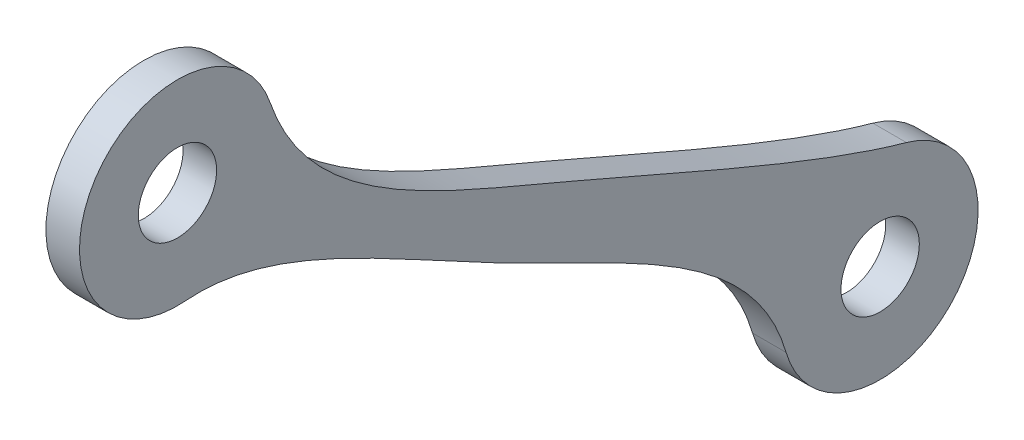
ISO-10303-21;
HEADER;
FILE_DESCRIPTION(('STEP AP214'),'2;1');
FILE_NAME('part.step','',(''),(''),'','','');
FILE_SCHEMA(('AUTOMOTIVE_DESIGN { 1 0 10303 214 1 1 1 1 }'));
ENDSEC;
DATA;
#1=APPLICATION_CONTEXT('core data for automotive mechanical design processes');
#2=APPLICATION_PROTOCOL_DEFINITION('international standard','automotive_design',2000,#1);
#3=PRODUCT_CONTEXT('',#1,'mechanical');
#4=PRODUCT('Part','Part','',(#3));
#5=PRODUCT_RELATED_PRODUCT_CATEGORY('part','',(#4));
#6=PRODUCT_DEFINITION_FORMATION('','',#4);
#7=PRODUCT_DEFINITION_CONTEXT('part definition',#1,'design');
#8=PRODUCT_DEFINITION('design','',#6,#7);
#9=PRODUCT_DEFINITION_SHAPE('','',#8);
#10=(LENGTH_UNIT() NAMED_UNIT(*) SI_UNIT(.MILLI.,.METRE.));
#11=(NAMED_UNIT(*) PLANE_ANGLE_UNIT() SI_UNIT($,.RADIAN.));
#12=(NAMED_UNIT(*) SI_UNIT($,.STERADIAN.) SOLID_ANGLE_UNIT());
#13=UNCERTAINTY_MEASURE_WITH_UNIT(LENGTH_MEASURE(1.E-05),#10,'distance_accuracy_value','');
#14=(GEOMETRIC_REPRESENTATION_CONTEXT(3) GLOBAL_UNCERTAINTY_ASSIGNED_CONTEXT((#13)) GLOBAL_UNIT_ASSIGNED_CONTEXT((#10,
#11,#12)) REPRESENTATION_CONTEXT('',''));
#15=CARTESIAN_POINT('',(0.,0.,0.));
#16=DIRECTION('',(0.,0.,1.));
#17=DIRECTION('',(1.,0.,0.));
#18=AXIS2_PLACEMENT_3D('',#15,#16,#17);
#19=CARTESIAN_POINT('',(-1.13097354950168,47.4370138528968,41.71175698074));
#20=DIRECTION('',(1.,0.,0.));
#21=DIRECTION('',(0.,0.,-1.));
#22=AXIS2_PLACEMENT_3D('',#19,#20,#21);
#23=CYLINDRICAL_SURFACE('',#22,8.75);
#24=DIRECTION('',(-1.,0.,0.));
#25=VECTOR('',#24,1.);
#26=CARTESIAN_POINT('',(-1.13097354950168,38.7172742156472,40.9846801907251));
#27=LINE('',#26,#25);
#28=CARTESIAN_POINT('',(1.86902645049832,38.7172742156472,40.9846801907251));
#29=VERTEX_POINT('',#28);
#30=CARTESIAN_POINT('',(-1.13097354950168,38.7172742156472,40.9846801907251));
#31=VERTEX_POINT('',#30);
#32=EDGE_CURVE('E11',#29,#31,#27,.T.);
#33=ORIENTED_EDGE('',*,*,#32,.F.);
#34=CARTESIAN_POINT('',(1.86902645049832,47.4370138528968,41.71175698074));
#35=DIRECTION('',(1.,0.,0.));
#36=DIRECTION('',(0.,0.,-1.));
#37=AXIS2_PLACEMENT_3D('',#34,#35,#36);
#38=CIRCLE('',#37,8.75);
#39=CARTESIAN_POINT('',(1.86902645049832,50.2754909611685,33.4349491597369));
#40=VERTEX_POINT('',#39);
#41=EDGE_CURVE('E98',#40,#29,#38,.T.);
#42=ORIENTED_EDGE('',*,*,#41,.F.);
#43=DIRECTION('',(-1.,0.,0.));
#44=VECTOR('',#43,1.);
#45=CARTESIAN_POINT('',(-1.13097354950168,50.2754909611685,33.4349491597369));
#46=LINE('',#45,#44);
#47=CARTESIAN_POINT('',(-1.13097354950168,50.2754909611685,33.4349491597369));
#48=VERTEX_POINT('',#47);
#49=EDGE_CURVE('E52',#40,#48,#46,.T.);
#50=ORIENTED_EDGE('',*,*,#49,.T.);
#51=CARTESIAN_POINT('',(-1.13097354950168,47.4370138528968,41.71175698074));
#52=DIRECTION('',(1.,0.,0.));
#53=DIRECTION('',(0.,0.,-1.));
#54=AXIS2_PLACEMENT_3D('',#51,#52,#53);
#55=CIRCLE('',#54,8.75);
#56=EDGE_CURVE('E128',#48,#31,#55,.T.);
#57=ORIENTED_EDGE('',*,*,#56,.T.);
#58=EDGE_LOOP('',(#33,#42,#50,#57));
#59=FACE_BOUND('',#58,.T.);
#60=ADVANCED_FACE('F42',(#59),#23,.T.);
#61=CARTESIAN_POINT('',(-1.13097354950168,50.2754909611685,33.4349491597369));
#62=CARTESIAN_POINT('',(-1.13097354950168,40.2797838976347,30.0069867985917));
#63=CARTESIAN_POINT('',(-1.13097354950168,31.5510925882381,7.34232732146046));
#64=CARTESIAN_POINT('',(-1.13097354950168,21.1323833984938,-14.8916890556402));
#65=CARTESIAN_POINT('',(-1.13097354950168,18.7643385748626,-23.4045328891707));
#66=B_SPLINE_CURVE_WITH_KNOTS('',3,(#61,#62,#63,#64,#65),.UNSPECIFIED.,.F.,.F.,(4,1,4),(0.,
0.472412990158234,1.),.UNSPECIFIED.);
#67=DIRECTION('',(1.,0.,0.));
#68=VECTOR('',#67,1.);
#69=SURFACE_OF_LINEAR_EXTRUSION('',#66,#68);
#70=ORIENTED_EDGE('',*,*,#49,.F.);
#71=CARTESIAN_POINT('',(1.86902645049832,50.2754909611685,33.4349491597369));
#72=CARTESIAN_POINT('',(1.86902645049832,40.2797838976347,30.0069867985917));
#73=CARTESIAN_POINT('',(1.86902645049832,31.5510925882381,7.34232732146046));
#74=CARTESIAN_POINT('',(1.86902645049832,21.1323833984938,-14.8916890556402));
#75=CARTESIAN_POINT('',(1.86902645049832,18.7643385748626,-23.4045328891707));
#76=B_SPLINE_CURVE_WITH_KNOTS('',3,(#71,#72,#73,#74,#75),.UNSPECIFIED.,.F.,.F.,(4,1,4),(0.,
0.472412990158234,1.),.UNSPECIFIED.);
#77=CARTESIAN_POINT('',(1.86902645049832,18.7643385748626,-23.4045328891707));
#78=VERTEX_POINT('',#77);
#79=EDGE_CURVE('E109',#40,#78,#76,.T.);
#80=ORIENTED_EDGE('',*,*,#79,.T.);
#81=DIRECTION('',(-1.,0.,0.));
#82=VECTOR('',#81,1.);
#83=CARTESIAN_POINT('',(-1.13097354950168,18.7643385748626,-23.4045328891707));
#84=LINE('',#83,#82);
#85=CARTESIAN_POINT('',(-1.13097354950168,18.7643385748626,-23.4045328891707));
#86=VERTEX_POINT('',#85);
#87=EDGE_CURVE('E60',#78,#86,#84,.T.);
#88=ORIENTED_EDGE('',*,*,#87,.T.);
#89=EDGE_CURVE('E133',#48,#86,#66,.T.);
#90=ORIENTED_EDGE('',*,*,#89,.F.);
#91=EDGE_LOOP('',(#70,#80,#88,#90));
#92=FACE_BOUND('',#91,.T.);
#93=ADVANCED_FACE('F135',(#92),#69,.F.);
#94=CARTESIAN_POINT('',(-1.13097354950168,10.3344169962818,-21.0595548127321));
#95=DIRECTION('',(1.,0.,0.));
#96=DIRECTION('',(0.,0.,-1.));
#97=AXIS2_PLACEMENT_3D('',#94,#95,#96);
#98=CYLINDRICAL_SURFACE('',#97,8.75);
#99=ORIENTED_EDGE('',*,*,#87,.F.);
#100=CARTESIAN_POINT('',(1.86902645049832,10.3344169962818,-21.0595548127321));
#101=DIRECTION('',(1.,0.,0.));
#102=DIRECTION('',(0.,0.,-1.));
#103=AXIS2_PLACEMENT_3D('',#100,#101,#102);
#104=CIRCLE('',#103,8.75);
#105=CARTESIAN_POINT('',(1.86902645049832,7.90402575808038,-12.6538604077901));
#106=VERTEX_POINT('',#105);
#107=EDGE_CURVE('E97',#106,#78,#104,.T.);
#108=ORIENTED_EDGE('',*,*,#107,.F.);
#109=DIRECTION('',(-1.,0.,0.));
#110=VECTOR('',#109,1.);
#111=CARTESIAN_POINT('',(-1.13097354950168,7.90402575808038,-12.6538604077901));
#112=LINE('',#111,#110);
#113=CARTESIAN_POINT('',(-1.13097354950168,7.90402575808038,-12.6538604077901));
#114=VERTEX_POINT('',#113);
#115=EDGE_CURVE('E46',#106,#114,#112,.T.);
#116=ORIENTED_EDGE('',*,*,#115,.T.);
#117=CARTESIAN_POINT('',(-1.13097354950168,10.3344169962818,-21.0595548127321));
#118=DIRECTION('',(1.,0.,0.));
#119=DIRECTION('',(0.,0.,-1.));
#120=AXIS2_PLACEMENT_3D('',#117,#118,#119);
#121=CIRCLE('',#120,8.75);
#122=EDGE_CURVE('E125',#114,#86,#121,.T.);
#123=ORIENTED_EDGE('',*,*,#122,.T.);
#124=EDGE_LOOP('',(#99,#108,#116,#123));
#125=FACE_BOUND('',#124,.T.);
#126=ADVANCED_FACE('F100',(#125),#98,.T.);
#127=CARTESIAN_POINT('',(-1.13097354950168,38.7172742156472,40.9846801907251));
#128=CARTESIAN_POINT('',(-1.13097354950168,39.3976779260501,32.8246848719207));
#129=CARTESIAN_POINT('',(-1.13097354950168,25.6400147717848,12.253604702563));
#130=CARTESIAN_POINT('',(-1.13097354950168,17.5543628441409,-9.86359781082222));
#131=CARTESIAN_POINT('',(-1.13097354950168,7.90402575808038,-12.6538604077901));
#132=B_SPLINE_CURVE_WITH_KNOTS('',3,(#127,#128,#129,#130,#131),.UNSPECIFIED.,.F.,.F.,(4,1,4),
(0.,0.508287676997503,1.),.UNSPECIFIED.);
#133=DIRECTION('',(1.,0.,0.));
#134=VECTOR('',#133,1.);
#135=SURFACE_OF_LINEAR_EXTRUSION('',#132,#134);
#136=CARTESIAN_POINT('',(1.86902645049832,38.7172742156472,40.9846801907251));
#137=CARTESIAN_POINT('',(1.86902645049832,39.3976779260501,32.8246848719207));
#138=CARTESIAN_POINT('',(1.86902645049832,25.6400147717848,12.253604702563));
#139=CARTESIAN_POINT('',(1.86902645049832,17.5543628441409,-9.86359781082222));
#140=CARTESIAN_POINT('',(1.86902645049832,7.90402575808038,-12.6538604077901));
#141=B_SPLINE_CURVE_WITH_KNOTS('',3,(#136,#137,#138,#139,#140),.UNSPECIFIED.,.F.,.F.,(4,1,4),
(0.,0.508287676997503,1.),.UNSPECIFIED.);
#142=EDGE_CURVE('E85',#29,#106,#141,.T.);
#143=ORIENTED_EDGE('',*,*,#142,.F.);
#144=ORIENTED_EDGE('',*,*,#32,.T.);
#145=EDGE_CURVE('E87',#31,#114,#132,.T.);
#146=ORIENTED_EDGE('',*,*,#145,.T.);
#147=ORIENTED_EDGE('',*,*,#115,.F.);
#148=EDGE_LOOP('',(#143,#144,#146,#147));
#149=FACE_BOUND('',#148,.T.);
#150=ADVANCED_FACE('F84',(#149),#135,.T.);
#151=CARTESIAN_POINT('',(-1.13097354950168,10.3344169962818,-21.0595548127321));
#152=DIRECTION('',(1.,0.,0.));
#153=DIRECTION('',(0.,0.,-1.));
#154=AXIS2_PLACEMENT_3D('',#151,#152,#153);
#155=CYLINDRICAL_SURFACE('',#154,3.5);
#156=CARTESIAN_POINT('',(-1.13097354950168,10.3344169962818,-21.0595548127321));
#157=DIRECTION('',(1.,0.,0.));
#158=DIRECTION('',(0.,0.,-1.));
#159=AXIS2_PLACEMENT_3D('',#156,#157,#158);
#160=CIRCLE('',#159,3.5);
#161=CARTESIAN_POINT('',(-1.13097354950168,10.3344169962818,-24.5595548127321));
#162=VERTEX_POINT('',#161);
#163=EDGE_CURVE('E91',#162,#162,#160,.T.);
#164=ORIENTED_EDGE('',*,*,#163,.F.);
#165=EDGE_LOOP('',(#164));
#166=FACE_BOUND('',#165,.T.);
#167=CARTESIAN_POINT('',(1.86902645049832,10.3344169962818,-21.0595548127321));
#168=DIRECTION('',(1.,0.,0.));
#169=DIRECTION('',(0.,0.,-1.));
#170=AXIS2_PLACEMENT_3D('',#167,#168,#169);
#171=CIRCLE('',#170,3.5);
#172=CARTESIAN_POINT('',(1.86902645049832,10.3344169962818,-24.5595548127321));
#173=VERTEX_POINT('',#172);
#174=EDGE_CURVE('E113',#173,#173,#171,.T.);
#175=ORIENTED_EDGE('',*,*,#174,.T.);
#176=EDGE_LOOP('',(#175));
#177=FACE_BOUND('',#176,.T.);
#178=ADVANCED_FACE('F44',(#166,#177),#155,.F.);
#179=CARTESIAN_POINT('',(-1.13097354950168,-11.9619343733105,-2.10593486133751));
#180=DIRECTION('',(1.,0.,0.));
#181=DIRECTION('',(0.,0.,-1.));
#182=AXIS2_PLACEMENT_3D('',#179,#180,#181);
#183=PLANE('',#182);
#184=CARTESIAN_POINT('',(-1.13097354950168,47.4370138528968,41.71175698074));
#185=DIRECTION('',(-1.,0.,0.));
#186=DIRECTION('',(0.,0.,1.));
#187=AXIS2_PLACEMENT_3D('',#184,#185,#186);
#188=CIRCLE('',#187,3.5);
#189=CARTESIAN_POINT('',(-1.13097354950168,47.4370138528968,45.21175698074));
#190=VERTEX_POINT('',#189);
#191=EDGE_CURVE('E104',#190,#190,#188,.T.);
#192=ORIENTED_EDGE('',*,*,#191,.F.);
#193=EDGE_LOOP('',(#192));
#194=FACE_BOUND('',#193,.T.);
#195=ORIENTED_EDGE('',*,*,#122,.F.);
#196=ORIENTED_EDGE('',*,*,#145,.F.);
#197=ORIENTED_EDGE('',*,*,#56,.F.);
#198=ORIENTED_EDGE('',*,*,#89,.T.);
#199=EDGE_LOOP('',(#195,#196,#197,#198));
#200=FACE_BOUND('',#199,.T.);
#201=ORIENTED_EDGE('',*,*,#163,.T.);
#202=EDGE_LOOP('',(#201));
#203=FACE_BOUND('',#202,.T.);
#204=ADVANCED_FACE('F131',(#194,#200,#203),#183,.F.);
#205=CARTESIAN_POINT('',(1.86902645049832,-11.9619343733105,-2.10593486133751));
#206=DIRECTION('',(1.,0.,0.));
#207=DIRECTION('',(0.,0.,-1.));
#208=AXIS2_PLACEMENT_3D('',#205,#206,#207);
#209=PLANE('',#208);
#210=CARTESIAN_POINT('',(1.86902645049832,47.4370138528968,41.71175698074));
#211=DIRECTION('',(-1.,0.,0.));
#212=DIRECTION('',(0.,0.,1.));
#213=AXIS2_PLACEMENT_3D('',#210,#211,#212);
#214=CIRCLE('',#213,3.5);
#215=CARTESIAN_POINT('',(1.86902645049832,47.4370138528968,45.21175698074));
#216=VERTEX_POINT('',#215);
#217=EDGE_CURVE('E101',#216,#216,#214,.T.);
#218=ORIENTED_EDGE('',*,*,#217,.T.);
#219=EDGE_LOOP('',(#218));
#220=FACE_BOUND('',#219,.T.);
#221=ORIENTED_EDGE('',*,*,#107,.T.);
#222=ORIENTED_EDGE('',*,*,#79,.F.);
#223=ORIENTED_EDGE('',*,*,#41,.T.);
#224=ORIENTED_EDGE('',*,*,#142,.T.);
#225=EDGE_LOOP('',(#221,#222,#223,#224));
#226=FACE_BOUND('',#225,.T.);
#227=ORIENTED_EDGE('',*,*,#174,.F.);
#228=EDGE_LOOP('',(#227));
#229=FACE_BOUND('',#228,.T.);
#230=ADVANCED_FACE('F94',(#220,#226,#229),#209,.T.);
#231=CARTESIAN_POINT('',(1.86902645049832,47.4370138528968,41.71175698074));
#232=DIRECTION('',(-1.,0.,0.));
#233=DIRECTION('',(0.,0.,1.));
#234=AXIS2_PLACEMENT_3D('',#231,#232,#233);
#235=CYLINDRICAL_SURFACE('',#234,3.5);
#236=ORIENTED_EDGE('',*,*,#217,.F.);
#237=EDGE_LOOP('',(#236));
#238=FACE_BOUND('',#237,.T.);
#239=ORIENTED_EDGE('',*,*,#191,.T.);
#240=EDGE_LOOP('',(#239));
#241=FACE_BOUND('',#240,.T.);
#242=ADVANCED_FACE('F162',(#238,#241),#235,.F.);
#243=CLOSED_SHELL('',(#60,#93,#126,#150,#178,#204,#230,#242));
#244=MANIFOLD_SOLID_BREP('B2',#243);
#245=ADVANCED_BREP_SHAPE_REPRESENTATION('',(#18,#244),#14);
#246=SHAPE_DEFINITION_REPRESENTATION(#9,#245);
ENDSEC;
END-ISO-10303-21;
